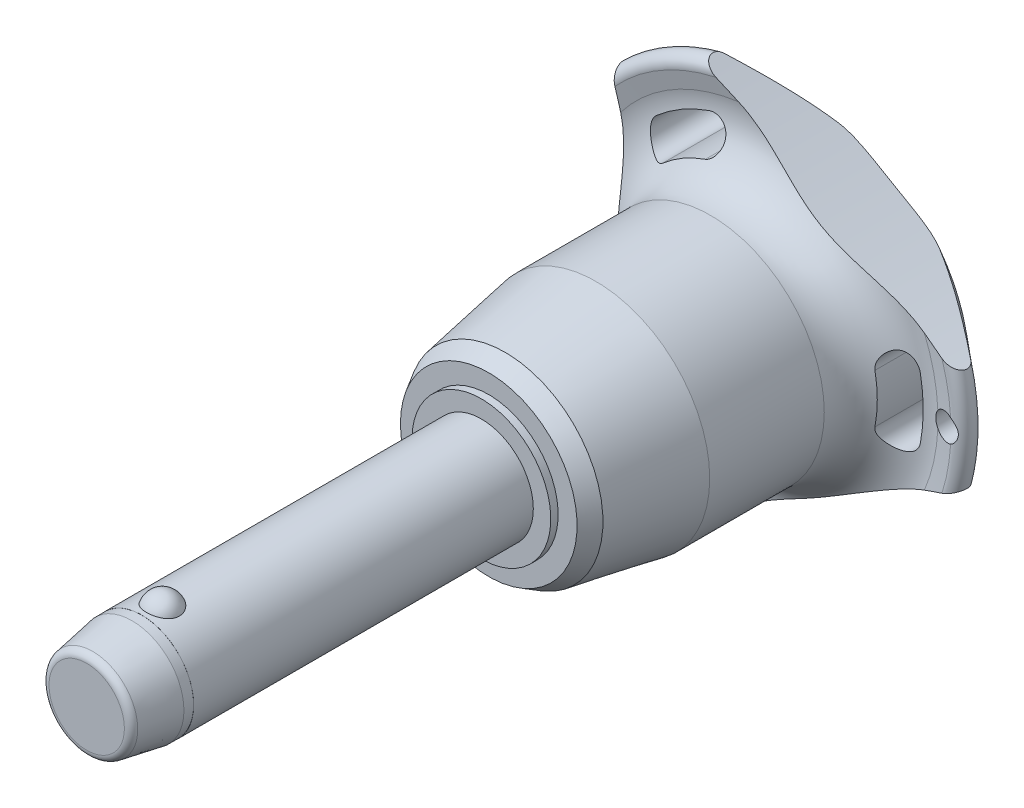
from build123d import *

# Parameters (mm, degrees)
SKETCH1_R           = 6
BOSS_EXTRUDE1_DEPTH = 35
SKETCH2_R           = 5.15
BOSS_EXTRUDE2_DEPTH = 39.7
BOSS_EXTRUDE3_START = 10.6
SKETCH1_2_R         = 6
BOSS_EXTRUDE3_DEPTH = 10.6
CHAMFER1_SIZE       = 5.3
CHAMFER1_SIZE2      = 0.934532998
FILLET1_R           = 0.85
SKETCH6_R           = 144.275
CUT_EXTRUDE1_DEPTH  = 82.935434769
CIRPATTERN1_COUNT   = 3
SKETCH7_R           = 1.5
CUT_EXTRUDE2_DEPTH  = 82.690131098
SKETCH8_R           = 6
SKETCH8_R_2         = 5.99
CUT_EXTRUDE3_DEPTH  = 6.36


with BuildPart() as part:
    # Sketch1 → Boss-Extrude1 (new body)
    with BuildSketch(Plane.XY):
        Circle(SKETCH1_R)
    extrude(amount=-BOSS_EXTRUDE1_DEPTH)

    # Sketch2 → Boss-Extrude2 (add)
    with BuildSketch(Plane(origin=(0, 0, -35), x_dir=(-1, 0, 0), z_dir=(0, 0, -1))):
        Circle(SKETCH2_R)
    extrude(amount=BOSS_EXTRUDE2_DEPTH)

    # Sketch3 → Revolve1 (revolve)
    with BuildSketch(Plane(origin=(0, 0, 0), x_dir=(0, 0, -1), z_dir=(1, 0, 0))):
        with BuildLine():
            Line((-1.854049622, 7.25), (-1.854049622, 3.25))
            ThreePointArc((-1.854049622, 3.25), (0.145950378, 5.25), (-1.854049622, 7.25))
        make_face()
        with BuildLine():
            Line((-1.854049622, -3.25), (-1.854049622, -7.25))
            ThreePointArc((-1.854049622, -7.25), (0.145950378, -5.25), (-1.854049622, -3.25))
        make_face()
    revolve(axis=Axis((0, -3.25, 1.854049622), (0, 1, 0)))

    # Sketch1_2 → Boss-Extrude3 (add)
    with BuildSketch(Plane.XY.offset(BOSS_EXTRUDE3_START)):
        Circle(SKETCH1_2_R)
    extrude(amount=-BOSS_EXTRUDE3_DEPTH)

    # Chamfer1
    chamfer1_edges = [part.edges().sort_by_distance(p)[0] for p in [
        (-6, 0, 10.6),
    ]]
    chamfer1_side = [part.faces().sort_by_distance(p)[0] for p in [
        (-6, 0, -12.2),
    ]]
    chamfer(chamfer1_edges, length=CHAMFER1_SIZE, length2=CHAMFER1_SIZE2, reference=chamfer1_side[0])

    # Fillet1
    fillet1_edges = [part.edges().sort_by_distance(p)[0] for p in [
        (-5.065467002, 0, 10.6),
        (5.15, 0, -74.7),
    ]]
    fillet(fillet1_edges, radius=FILLET1_R)

    # Sketch4 → Revolve2 (revolve)
    with BuildSketch(Plane(origin=(0, 0, 0), x_dir=(0, 0, -1), z_dir=(1, 0, 0)), mode=Mode.PRIVATE) as revolve2_sk:
        Polygon((35, 0), (35, 8.017240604), (35.85, 8.017240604), (35.85, 10.206249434), (37.745737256, 11.300753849), (48.233333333, 13.15), (61.466666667, 13.15), (61.466666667, 0), align=None)
    revolve(revolve2_sk.sketch.rotate(Axis((0, 0, -61.466666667), (0, 0, 1)), 90), axis=Axis((0, 0, -61.466666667), (0, 0, 1)))

    # Sketch5 → Revolve3 (revolve)
    with BuildSketch(Plane(origin=(0, 0, 0), x_dir=(0, 0, -1), z_dir=(1, 0, 0)), mode=Mode.PRIVATE) as revolve3_sk:
        with BuildLine():
            Line((67.32877039, 20.428960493), (66.910912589, 22.344207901))
            ThreePointArc((66.910912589, 22.344207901), (67.554394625, 23.677136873), (69.002586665, 23.371345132))
            Line((69.002586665, 23.371345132), (74.141488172, 17.247040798))
            ThreePointArc((74.141488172, 17.247040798), (74.7, 15.584758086), (73.978803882, 13.986322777))
            ThreePointArc((73.978803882, 13.986322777), (69.617427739, 7.589034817), (68.083333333, 0))
            Line((68.083333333, 0), (61.466666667, 0))
            Line((61.466666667, 0), (61.466666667, 13.15))
            ThreePointArc((61.466666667, 13.15), (66.139661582, 15.38660811), (67.32877039, 20.428960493))
        make_face()
    revolve(revolve3_sk.sketch.rotate(Axis((0, 0, -68.083333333), (0, 0, 1)), 90), axis=Axis((0, 0, -68.083333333), (0, 0, 1)))

    # Sketch6 → Cut-Extrude1 (cut, through all)
    with BuildSketch(Plane.XY):
        with Locations((-159.975, 0)):
            Circle(SKETCH6_R)
        with BuildLine():
            ThreePointArc((18.274208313, -3.515166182), (18.60922037, 0), (18.274208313, 3.515166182))
            ThreePointArc((18.274208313, 3.515166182), (16.143490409, 4.958408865), (14.700247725, 2.827690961))
            ThreePointArc((14.700247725, 2.827690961), (14.969740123, 0), (14.700247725, -2.827690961))
            ThreePointArc((14.700247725, -2.827690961), (16.143490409, -4.958408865), (18.274208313, -3.515166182))
        make_face()
    cut_extrude1 = extrude(amount=-CUT_EXTRUDE1_DEPTH, mode=Mode.SUBTRACT)

    # CirPattern1: Cut-Extrude1 ×3 about axis
    cirpattern1_axis = Axis((0, 0, 0), (0, 0, 1))
    for i in range(1, CIRPATTERN1_COUNT):
        add(cut_extrude1.rotate(cirpattern1_axis, i * 360 / CIRPATTERN1_COUNT), mode=Mode.SUBTRACT)

    # Sketch7 → Cut-Extrude2 (cut, through all)
    with BuildSketch(Plane.XY):
        with Locations(Location((21.60922037, 0, 0), (0, 0, 297.620773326))):
            Circle(SKETCH7_R)
    extrude(amount=-CUT_EXTRUDE2_DEPTH, mode=Mode.SUBTRACT)

    # Sketch8 → Cut-Extrude3 (cut)
    with BuildSketch(Plane.XY.offset(10.6)):
        Circle(SKETCH8_R)
        Circle(SKETCH8_R_2, mode=Mode.SUBTRACT)
    extrude(amount=-CUT_EXTRUDE3_DEPTH, mode=Mode.SUBTRACT)


solid = part.part
